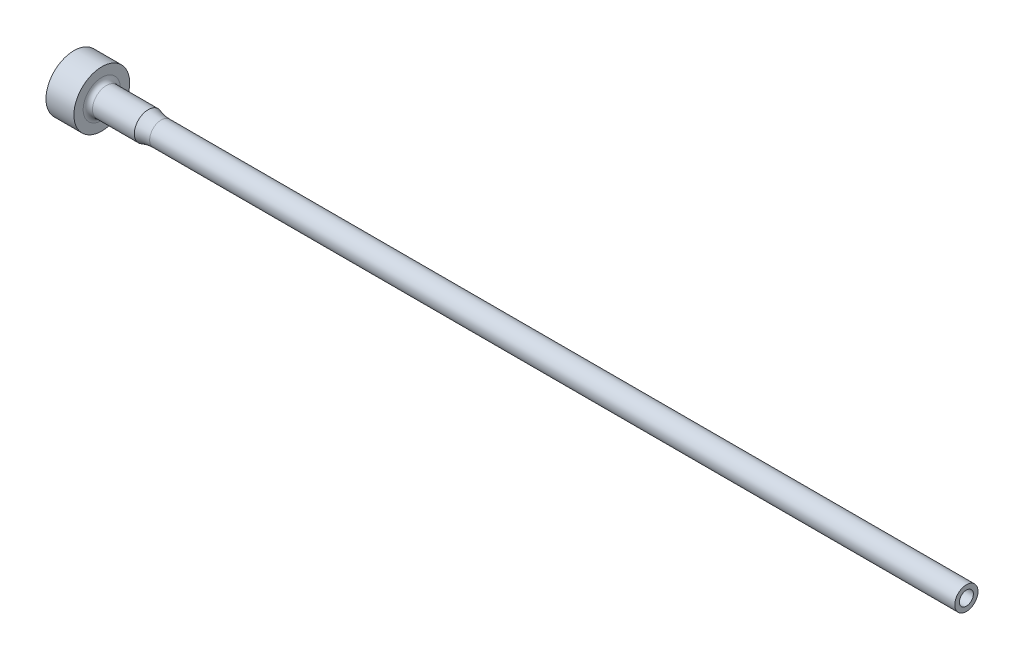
ISO-10303-21;
HEADER;
FILE_DESCRIPTION(('STEP AP214'),'2;1');
FILE_NAME('part.step','',(''),(''),'','','');
FILE_SCHEMA(('AUTOMOTIVE_DESIGN { 1 0 10303 214 1 1 1 1 }'));
ENDSEC;
DATA;
#1=APPLICATION_CONTEXT('core data for automotive mechanical design processes');
#2=APPLICATION_PROTOCOL_DEFINITION('international standard','automotive_design',2000,#1);
#3=PRODUCT_CONTEXT('',#1,'mechanical');
#4=PRODUCT('Part','Part','',(#3));
#5=PRODUCT_RELATED_PRODUCT_CATEGORY('part','',(#4));
#6=PRODUCT_DEFINITION_FORMATION('','',#4);
#7=PRODUCT_DEFINITION_CONTEXT('part definition',#1,'design');
#8=PRODUCT_DEFINITION('design','',#6,#7);
#9=PRODUCT_DEFINITION_SHAPE('','',#8);
#10=(LENGTH_UNIT() NAMED_UNIT(*) SI_UNIT(.MILLI.,.METRE.));
#11=(NAMED_UNIT(*) PLANE_ANGLE_UNIT() SI_UNIT($,.RADIAN.));
#12=(NAMED_UNIT(*) SI_UNIT($,.STERADIAN.) SOLID_ANGLE_UNIT());
#13=UNCERTAINTY_MEASURE_WITH_UNIT(LENGTH_MEASURE(1.E-05),#10,'distance_accuracy_value','');
#14=(GEOMETRIC_REPRESENTATION_CONTEXT(3) GLOBAL_UNCERTAINTY_ASSIGNED_CONTEXT((#13)) GLOBAL_UNIT_ASSIGNED_CONTEXT((#10,
#11,#12)) REPRESENTATION_CONTEXT('',''));
#15=CARTESIAN_POINT('',(0.,0.,0.));
#16=DIRECTION('',(0.,0.,1.));
#17=DIRECTION('',(1.,0.,0.));
#18=AXIS2_PLACEMENT_3D('',#15,#16,#17);
#19=CARTESIAN_POINT('',(101.599999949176,0.,0.));
#20=DIRECTION('',(-1.,0.,0.));
#21=DIRECTION('',(0.,0.,1.));
#22=AXIS2_PLACEMENT_3D('',#19,#20,#21);
#23=CYLINDRICAL_SURFACE('',#22,4.76249999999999);
#24=CARTESIAN_POINT('',(-5.08240671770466E-08,0.,0.));
#25=DIRECTION('',(-1.,0.,0.));
#26=DIRECTION('',(0.,0.,1.));
#27=AXIS2_PLACEMENT_3D('',#24,#25,#26);
#28=CIRCLE('',#27,4.76249999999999);
#29=CARTESIAN_POINT('',(-5.08240671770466E-08,0.,4.76249999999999));
#30=VERTEX_POINT('',#29);
#31=EDGE_CURVE('E10',#30,#30,#28,.T.);
#32=ORIENTED_EDGE('',*,*,#31,.F.);
#33=EDGE_LOOP('',(#32));
#34=FACE_BOUND('',#33,.T.);
#35=CARTESIAN_POINT('',(4.76249994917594,0.,0.));
#36=DIRECTION('',(-1.,0.,0.));
#37=DIRECTION('',(0.,0.,1.));
#38=AXIS2_PLACEMENT_3D('',#35,#36,#37);
#39=CIRCLE('',#38,4.76249999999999);
#40=CARTESIAN_POINT('',(4.76249994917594,0.,4.76249999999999));
#41=VERTEX_POINT('',#40);
#42=EDGE_CURVE('E67',#41,#41,#39,.T.);
#43=ORIENTED_EDGE('',*,*,#42,.T.);
#44=EDGE_LOOP('',(#43));
#45=FACE_BOUND('',#44,.T.);
#46=ADVANCED_FACE('F27',(#34,#45),#23,.T.);
#47=CARTESIAN_POINT('',(-5.08240695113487E-08,4.76249999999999,0.));
#48=DIRECTION('',(1.,0.,0.));
#49=DIRECTION('',(0.,0.,-1.));
#50=AXIS2_PLACEMENT_3D('',#47,#48,#49);
#51=PLANE('',#50);
#52=CARTESIAN_POINT('',(-5.08240671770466E-08,0.,0.));
#53=DIRECTION('',(-1.,0.,0.));
#54=DIRECTION('',(0.,0.,1.));
#55=AXIS2_PLACEMENT_3D('',#52,#53,#54);
#56=CIRCLE('',#55,2.07962500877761);
#57=CARTESIAN_POINT('',(-5.08240671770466E-08,0.,2.07962500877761));
#58=VERTEX_POINT('',#57);
#59=EDGE_CURVE('E33',#58,#58,#56,.T.);
#60=ORIENTED_EDGE('',*,*,#59,.F.);
#61=EDGE_LOOP('',(#60));
#62=FACE_BOUND('',#61,.T.);
#63=ORIENTED_EDGE('',*,*,#31,.T.);
#64=EDGE_LOOP('',(#63));
#65=FACE_BOUND('',#64,.T.);
#66=ADVANCED_FACE('F128',(#62,#65),#51,.F.);
#67=CARTESIAN_POINT('',(-5.08240671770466E-08,0.,0.));
#68=DIRECTION('',(-1.,0.,0.));
#69=DIRECTION('',(0.,0.,1.));
#70=AXIS2_PLACEMENT_3D('',#67,#68,#69);
#71=CONICAL_SURFACE('',#70,2.07962500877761,0.785398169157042);
#72=CARTESIAN_POINT('',(0.761999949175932,0.,0.));
#73=DIRECTION('',(-1.,0.,0.));
#74=DIRECTION('',(0.,0.,1.));
#75=AXIS2_PLACEMENT_3D('',#72,#73,#74);
#76=CIRCLE('',#75,1.31762499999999);
#77=CARTESIAN_POINT('',(0.761999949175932,0.,1.31762499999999));
#78=VERTEX_POINT('',#77);
#79=EDGE_CURVE('E37',#78,#78,#76,.T.);
#80=ORIENTED_EDGE('',*,*,#79,.F.);
#81=EDGE_LOOP('',(#80));
#82=FACE_BOUND('',#81,.T.);
#83=ORIENTED_EDGE('',*,*,#59,.T.);
#84=EDGE_LOOP('',(#83));
#85=FACE_BOUND('',#84,.T.);
#86=ADVANCED_FACE('F123',(#82,#85),#71,.F.);
#87=CARTESIAN_POINT('',(101.599999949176,0.,0.));
#88=DIRECTION('',(-1.,0.,0.));
#89=DIRECTION('',(0.,0.,1.));
#90=AXIS2_PLACEMENT_3D('',#87,#88,#89);
#91=CYLINDRICAL_SURFACE('',#90,1.317625);
#92=CARTESIAN_POINT('',(107.876676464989,0.,0.));
#93=DIRECTION('',(-1.,0.,0.));
#94=DIRECTION('',(0.,0.,1.));
#95=AXIS2_PLACEMENT_3D('',#92,#93,#94);
#96=CIRCLE('',#95,1.317625);
#97=CARTESIAN_POINT('',(107.876676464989,0.,1.317625));
#98=VERTEX_POINT('',#97);
#99=EDGE_CURVE('E41',#98,#98,#96,.T.);
#100=ORIENTED_EDGE('',*,*,#99,.F.);
#101=EDGE_LOOP('',(#100));
#102=FACE_BOUND('',#101,.T.);
#103=ORIENTED_EDGE('',*,*,#79,.T.);
#104=EDGE_LOOP('',(#103));
#105=FACE_BOUND('',#104,.T.);
#106=ADVANCED_FACE('F117',(#102,#105),#91,.F.);
#107=CARTESIAN_POINT('',(107.876676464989,0.,0.));
#108=DIRECTION('',(-1.,0.,0.));
#109=DIRECTION('',(0.,0.,1.));
#110=AXIS2_PLACEMENT_3D('',#107,#108,#109);
#111=CONICAL_SURFACE('',#110,1.317625,1.04719755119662);
#112=CARTESIAN_POINT('',(107.949999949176,0.,0.));
#113=DIRECTION('',(-1.,0.,0.));
#114=DIRECTION('',(0.,0.,1.));
#115=AXIS2_PLACEMENT_3D('',#112,#113,#114);
#116=CIRCLE('',#115,1.190625);
#117=CARTESIAN_POINT('',(107.949999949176,0.,1.190625));
#118=VERTEX_POINT('',#117);
#119=EDGE_CURVE('E46',#118,#118,#116,.T.);
#120=ORIENTED_EDGE('',*,*,#119,.F.);
#121=EDGE_LOOP('',(#120));
#122=FACE_BOUND('',#121,.T.);
#123=ORIENTED_EDGE('',*,*,#99,.T.);
#124=EDGE_LOOP('',(#123));
#125=FACE_BOUND('',#124,.T.);
#126=ADVANCED_FACE('F111',(#122,#125),#111,.F.);
#127=CARTESIAN_POINT('',(101.599999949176,0.,0.));
#128=DIRECTION('',(-1.,0.,0.));
#129=DIRECTION('',(0.,0.,1.));
#130=AXIS2_PLACEMENT_3D('',#127,#128,#129);
#131=CYLINDRICAL_SURFACE('',#130,1.190625);
#132=CARTESIAN_POINT('',(152.399999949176,0.,0.));
#133=DIRECTION('',(-1.,0.,0.));
#134=DIRECTION('',(0.,0.,1.));
#135=AXIS2_PLACEMENT_3D('',#132,#133,#134);
#136=CIRCLE('',#135,1.19062499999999);
#137=CARTESIAN_POINT('',(152.399999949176,0.,1.19062499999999));
#138=VERTEX_POINT('',#137);
#139=EDGE_CURVE('E49',#138,#138,#136,.T.);
#140=ORIENTED_EDGE('',*,*,#139,.F.);
#141=EDGE_LOOP('',(#140));
#142=FACE_BOUND('',#141,.T.);
#143=ORIENTED_EDGE('',*,*,#119,.T.);
#144=EDGE_LOOP('',(#143));
#145=FACE_BOUND('',#144,.T.);
#146=ADVANCED_FACE('F105',(#142,#145),#131,.F.);
#147=CARTESIAN_POINT('',(152.399999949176,1.19062499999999,0.));
#148=DIRECTION('',(-1.,0.,0.));
#149=DIRECTION('',(0.,0.,1.));
#150=AXIS2_PLACEMENT_3D('',#147,#148,#149);
#151=PLANE('',#150);
#152=CARTESIAN_POINT('',(152.399999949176,0.,0.));
#153=DIRECTION('',(-1.,0.,0.));
#154=DIRECTION('',(0.,0.,1.));
#155=AXIS2_PLACEMENT_3D('',#152,#153,#154);
#156=CIRCLE('',#155,1.98501000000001);
#157=CARTESIAN_POINT('',(152.399999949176,0.,1.98501000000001));
#158=VERTEX_POINT('',#157);
#159=EDGE_CURVE('E52',#158,#158,#156,.T.);
#160=ORIENTED_EDGE('',*,*,#159,.F.);
#161=EDGE_LOOP('',(#160));
#162=FACE_BOUND('',#161,.T.);
#163=ORIENTED_EDGE('',*,*,#139,.T.);
#164=EDGE_LOOP('',(#163));
#165=FACE_BOUND('',#164,.T.);
#166=ADVANCED_FACE('F99',(#162,#165),#151,.F.);
#167=CARTESIAN_POINT('',(101.599999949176,0.,0.));
#168=DIRECTION('',(-1.,0.,0.));
#169=DIRECTION('',(0.,0.,1.));
#170=AXIS2_PLACEMENT_3D('',#167,#168,#169);
#171=CYLINDRICAL_SURFACE('',#170,1.98501);
#172=CARTESIAN_POINT('',(14.9250424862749,0.,0.));
#173=DIRECTION('',(-1.,0.,0.));
#174=DIRECTION('',(0.,0.,1.));
#175=AXIS2_PLACEMENT_3D('',#172,#173,#174);
#176=CIRCLE('',#175,1.98500999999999);
#177=CARTESIAN_POINT('',(14.9250424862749,0.,1.98500999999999));
#178=VERTEX_POINT('',#177);
#179=EDGE_CURVE('E55',#178,#178,#176,.T.);
#180=ORIENTED_EDGE('',*,*,#179,.F.);
#181=EDGE_LOOP('',(#180));
#182=FACE_BOUND('',#181,.T.);
#183=ORIENTED_EDGE('',*,*,#159,.T.);
#184=EDGE_LOOP('',(#183));
#185=FACE_BOUND('',#184,.T.);
#186=ADVANCED_FACE('F93',(#182,#185),#171,.T.);
#187=CARTESIAN_POINT('',(14.9250424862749,0.,0.));
#188=DIRECTION('',(-1.,0.,0.));
#189=DIRECTION('',(0.,0.,1.));
#190=AXIS2_PLACEMENT_3D('',#187,#188,#189);
#191=TOROIDAL_SURFACE('',#190,8.33500999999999,6.35);
#192=CARTESIAN_POINT('',(12.6999999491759,0.,0.));
#193=DIRECTION('',(-1.,0.,0.));
#194=DIRECTION('',(0.,0.,1.));
#195=AXIS2_PLACEMENT_3D('',#192,#193,#194);
#196=CIRCLE('',#195,2.38759999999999);
#197=CARTESIAN_POINT('',(12.6999999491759,0.,2.38759999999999));
#198=VERTEX_POINT('',#197);
#199=EDGE_CURVE('E58',#198,#198,#196,.T.);
#200=ORIENTED_EDGE('',*,*,#199,.F.);
#201=EDGE_LOOP('',(#200));
#202=FACE_BOUND('',#201,.T.);
#203=ORIENTED_EDGE('',*,*,#179,.T.);
#204=EDGE_LOOP('',(#203));
#205=FACE_BOUND('',#204,.T.);
#206=ADVANCED_FACE('F87',(#202,#205),#191,.F.);
#207=CARTESIAN_POINT('',(101.599999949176,0.,0.));
#208=DIRECTION('',(-1.,0.,0.));
#209=DIRECTION('',(0.,0.,1.));
#210=AXIS2_PLACEMENT_3D('',#207,#208,#209);
#211=CYLINDRICAL_SURFACE('',#210,2.38759999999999);
#212=CARTESIAN_POINT('',(5.55624994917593,0.,0.));
#213=DIRECTION('',(-1.,0.,0.));
#214=DIRECTION('',(0.,0.,1.));
#215=AXIS2_PLACEMENT_3D('',#212,#213,#214);
#216=CIRCLE('',#215,2.38759999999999);
#217=CARTESIAN_POINT('',(5.55624994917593,0.,2.38759999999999));
#218=VERTEX_POINT('',#217);
#219=EDGE_CURVE('E61',#218,#218,#216,.T.);
#220=ORIENTED_EDGE('',*,*,#219,.F.);
#221=EDGE_LOOP('',(#220));
#222=FACE_BOUND('',#221,.T.);
#223=ORIENTED_EDGE('',*,*,#199,.T.);
#224=EDGE_LOOP('',(#223));
#225=FACE_BOUND('',#224,.T.);
#226=ADVANCED_FACE('F81',(#222,#225),#211,.T.);
#227=CARTESIAN_POINT('',(5.55624994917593,0.,0.));
#228=DIRECTION('',(-1.,0.,0.));
#229=DIRECTION('',(0.,0.,1.));
#230=AXIS2_PLACEMENT_3D('',#227,#228,#229);
#231=TOROIDAL_SURFACE('',#230,3.18134999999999,0.79375);
#232=CARTESIAN_POINT('',(4.76249994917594,0.,0.));
#233=DIRECTION('',(-1.,0.,0.));
#234=DIRECTION('',(0.,0.,1.));
#235=AXIS2_PLACEMENT_3D('',#232,#233,#234);
#236=CIRCLE('',#235,3.18134999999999);
#237=CARTESIAN_POINT('',(4.76249994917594,0.,3.18134999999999));
#238=VERTEX_POINT('',#237);
#239=EDGE_CURVE('E64',#238,#238,#236,.T.);
#240=ORIENTED_EDGE('',*,*,#239,.F.);
#241=EDGE_LOOP('',(#240));
#242=FACE_BOUND('',#241,.T.);
#243=ORIENTED_EDGE('',*,*,#219,.T.);
#244=EDGE_LOOP('',(#243));
#245=FACE_BOUND('',#244,.T.);
#246=ADVANCED_FACE('F75',(#242,#245),#231,.F.);
#247=CARTESIAN_POINT('',(4.76249994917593,3.18134999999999,0.));
#248=DIRECTION('',(-1.,0.,0.));
#249=DIRECTION('',(0.,0.,1.));
#250=AXIS2_PLACEMENT_3D('',#247,#248,#249);
#251=PLANE('',#250);
#252=ORIENTED_EDGE('',*,*,#42,.F.);
#253=EDGE_LOOP('',(#252));
#254=FACE_BOUND('',#253,.T.);
#255=ORIENTED_EDGE('',*,*,#239,.T.);
#256=EDGE_LOOP('',(#255));
#257=FACE_BOUND('',#256,.T.);
#258=ADVANCED_FACE('F72',(#254,#257),#251,.F.);
#259=CLOSED_SHELL('',(#46,#66,#86,#106,#126,#146,#166,#186,#206,#226,#246,#258));
#260=MANIFOLD_SOLID_BREP('B2',#259);
#261=ADVANCED_BREP_SHAPE_REPRESENTATION('',(#18,#260),#14);
#262=SHAPE_DEFINITION_REPRESENTATION(#9,#261);
ENDSEC;
END-ISO-10303-21;
